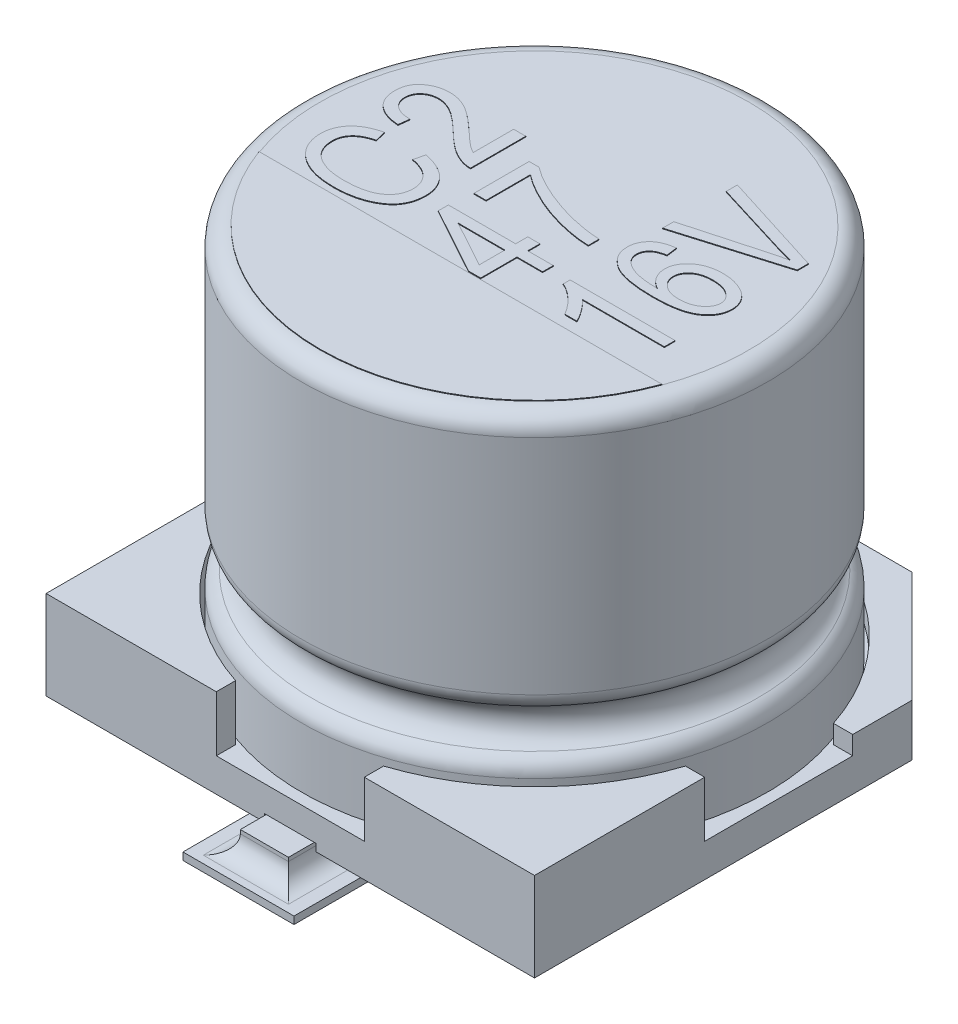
from build123d import *

# Parameters (mm, degrees)
SKETCH1_W                = 6.6
SKETCH1_H                = 6.6
BOSS_EXTRUDE1_DEPTH      = 1.2
CUT_EXTRUDE1_DEPTH       = 0.75
CUT_EXTRUDE2_DEPTH       = 5.902040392
CUT_EXTRUDE2_DEPTH_BACK  = 5.902040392
SKETCH3_W                = 3.3
SKETCH3_H                = 0.5
CHAMFER1_SIZE            = 1.5
CUT_EXTRUDE3_DEPTH       = 0.1
BOSS_EXTRUDE4_DEPTH      = 0.3
BOSS_EXTRUDE4_DEPTH_BACK = 0.1
SKETCH8_R                = 0.5
BOSS_EXTRUDE5_DEPTH      = 0.3
SKETCH9_W                = 1.5
SKETCH9_H                = 2
BOSS_EXTRUDE6_DEPTH      = 0.1
FILLET1_R                = 0.25
BOSS_EXTRUDE7_DEPTH      = 0.01


with BuildPart() as part:
    # Sketch1 → Boss-Extrude1 (new body)
    with BuildSketch(Plane(origin=(0, 0.3, 0), x_dir=(1, 0, 0), z_dir=(0, 1, 0))):
        Rectangle(SKETCH1_W, SKETCH1_H)
    extrude(amount=BOSS_EXTRUDE1_DEPTH)

    # Sketch2 → Cut-Extrude1 (cut)
    with BuildSketch(Plane(origin=(0, 1.5, 0), x_dir=(1, 0, 0), z_dir=(0, 1, 0))):
        with BuildLine():
            Line((-3.3, 1), (-3.039736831, 1))
            ThreePointArc((-3.039736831, 1), (-2.2627417, 2.2627417), (-1, 3.039736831))
            Line((-1, 3.039736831), (-1, 3.3))
            Line((-1, 3.3), (1, 3.3))
            Line((1, 3.3), (1, 3.039736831))
            ThreePointArc((1, 3.039736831), (2.2627417, 2.2627417), (3.039736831, 1))
            Line((3.039736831, 1), (3.3, 1))
            Line((3.3, 1), (3.3, -1))
            Line((3.3, -1), (3.039736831, -1))
            ThreePointArc((3.039736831, -1), (2.2627417, -2.2627417), (1, -3.039736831))
            Line((1, -3.039736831), (1, -3.3))
            Line((1, -3.3), (-1, -3.3))
            Line((-1, -3.3), (-1, -3.039736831))
            ThreePointArc((-1, -3.039736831), (-2.2627417, -2.2627417), (-3.039736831, -1))
            Line((-3.039736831, -1), (-3.3, -1))
            Line((-3.3, -1), (-3.3, 1))
        make_face()
    extrude(amount=-CUT_EXTRUDE1_DEPTH, mode=Mode.SUBTRACT)

    # Sketch3 → Cut-Extrude2 (cut, two sides: drawn at the far end of the back side and taken through both)
    with BuildSketch(Plane(origin=(0, 0, 0), x_dir=(0, 0, -1), z_dir=(1, 0, 0)).offset(-CUT_EXTRUDE2_DEPTH_BACK)):
        with Locations((1.65, 1.25)):
            Rectangle(SKETCH3_W, SKETCH3_H)
    extrude(amount=CUT_EXTRUDE2_DEPTH + CUT_EXTRUDE2_DEPTH_BACK, mode=Mode.SUBTRACT)

    # Chamfer1
    chamfer1_edges = [part.edges().sort_by_distance(p)[0] for p in [
        (3.3, 0.65, -3.3),
        (-3.3, 0.65, -3.3),
    ]]
    chamfer(chamfer1_edges, length=CHAMFER1_SIZE)

    # Sketch7 → Cut-Extrude3 (cut)
    with BuildSketch(Plane.XZ.offset(-0.3)):
        with BuildLine():
            Line((-0.35, 3.3), (0.35, 3.3))
            Line((0.35, 3.3), (0.498675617, 1.261367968))
            ThreePointArc((0.498675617, 1.261367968), (0, 0.725), (-0.498675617, 1.261367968))
            Line((-0.498675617, 1.261367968), (-0.35, 3.3))
        make_face()
        with BuildLine():
            Line((-0.35, -3.3), (0.35, -3.3))
            Line((0.35, -3.3), (0.498675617, -1.261367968))
            ThreePointArc((0.498675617, -1.261367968), (0, -0.725), (-0.498675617, -1.261367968))
            Line((-0.498675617, -1.261367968), (-0.35, -3.3))
        make_face()
    extrude(amount=-CUT_EXTRUDE3_DEPTH, mode=Mode.SUBTRACT)

    # Sketch6 → Boss-Extrude4 (add, two sides: drawn at the far end of the back side and taken through both)
    with BuildSketch(Plane.XZ.offset(-0.3).offset(-BOSS_EXTRUDE4_DEPTH_BACK)):
        with BuildLine():
            Line((-0.325, -1.225), (-0.325, -3.65))
            Line((-0.325, -3.65), (0.325, -3.65))
            Line((0.325, -3.65), (0.325, -1.225))
            ThreePointArc((0.325, -1.225), (0, -0.9), (-0.325, -1.225))
        make_face()
        with BuildLine():
            Line((-0.325, 1.225), (-0.325, 3.65))
            Line((-0.325, 3.65), (0.325, 3.65))
            Line((0.325, 3.65), (0.325, 1.225))
            ThreePointArc((0.325, 1.225), (0, 0.9), (-0.325, 1.225))
        make_face()
    extrude(amount=BOSS_EXTRUDE4_DEPTH + BOSS_EXTRUDE4_DEPTH_BACK)

    # Sketch8 → Boss-Extrude5 (add)
    with BuildSketch(Plane.XZ.offset(-0.3)):
        with Locations(Location((-2, 2, 0), (0, 0, 270))):
            Circle(SKETCH8_R)
        with Locations(Location((2, 2, 0), (0, 0, 270))):
            Circle(SKETCH8_R)
        with Locations(Location((2, -2, 0), (0, 0, 270))):
            Circle(SKETCH8_R)
        with Locations(Location((-2, -2, 0), (0, 0, 270))):
            Circle(SKETCH8_R)
    extrude(amount=BOSS_EXTRUDE5_DEPTH)

    # Sketch9 → Boss-Extrude6 (add)
    with BuildSketch(Plane(origin=(0, 0, 0), x_dir=(1, 0, 0), z_dir=(0, 1, 0))):
        with Locations((0, 3)):
            Rectangle(SKETCH9_W, SKETCH9_H)
        with Locations((0, -3)):
            Rectangle(SKETCH9_W, SKETCH9_H)
    extrude(amount=BOSS_EXTRUDE6_DEPTH)

    # Fillet1
    fillet1_edges = [part.edges().sort_by_distance(p)[0] for p in [
        (0.325, 0.1, -2.825),
        (0, 0.1, -3.65),
        (-0.325, 0.1, -2.825),
        (-0.325, 0.1, 2.825),
        (0, 0.1, 3.65),
        (0.325, 0.1, 2.825),
    ]]
    fillet(fillet1_edges, radius=FILLET1_R)


with BuildPart() as body_2:
    # Sketch4 → Revolve1 (revolve)
    with BuildSketch(Plane(origin=(0, 0, 0), x_dir=(0, 0, -1), z_dir=(1, 0, 0)), mode=Mode.PRIVATE) as revolve1_sk:
        with BuildLine():
            Line((0, 0.75), (0, 5.8))
            Line((0, 5.8), (-2.9, 5.8))
            ThreePointArc((-2.9, 5.8), (-3.076776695, 5.726776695), (-3.15, 5.55))
            Line((-3.15, 5.55), (-3.15, 2.539897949))
            ThreePointArc((-3.15, 2.539897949), (-3.113200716, 2.409339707), (-3.013636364, 2.317217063))
            ThreePointArc((-3.013636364, 2.317217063), (-2.85, 2.05), (-3.013636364, 1.782782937))
            ThreePointArc((-3.013636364, 1.782782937), (-3.113200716, 1.690660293), (-3.15, 1.560102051))
            Line((-3.15, 1.560102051), (-3.15, 0.75))
            Line((-3.15, 0.75), (0, 0.75))
        make_face()
    revolve(revolve1_sk.sketch.rotate(Axis((0, 0, 0), (0, 1, 0)), 180), axis=Axis((0, 0, 0), (0, 1, 0)))

    # Sketch10 → Boss-Extrude7 (add)
    # profile 1 of 8: a face of its own
    with BuildSketch(Plane(origin=(0, 5.8, 0), x_dir=(1, 0, 0), z_dir=(0, 1, 0))):
        with BuildLine():
            Line((-2.722131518, -1), (2.722131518, -1))
            ThreePointArc((2.722131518, -1), (0, -2.9), (-2.722131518, -1))
        make_face()
    # profile 2 of 8: a face of its own
    with BuildSketch(Plane(origin=(0, 5.8, 0), x_dir=(1, 0, 0), z_dir=(0, 1, 0))):
        with BuildLine():
            Line((-1.590909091, -0.054545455), (-1.554545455, 0.090909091))
            add(Edge.make_bspline(
                [(-1.554545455, 0.090909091), (-1.535269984, 0.086573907), (-1.497690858, 0.078122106), (-1.443641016, 0.062267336), (-1.39347407, 0.043748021), (-1.347020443, 0.023039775), (-1.304271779, 0.000124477), (-1.26542753, -0.02529249), (-1.230157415, -0.052859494), (-1.199022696, -0.0830881), (-1.1711564, -0.11498153), (-1.147359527, -0.148885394), (-1.126876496, -0.184353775), (-1.110494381, -0.221648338), (-1.097542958, -0.26053486), (-1.088602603, -0.301197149), (-1.082613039, -0.343476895), (-1.082085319, -0.372327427), (-1.081818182, -0.386931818)],
                knots=[0, 0, 0, 0, 1.289353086, 2.513700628, 3.673385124, 4.777321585, 5.831023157, 6.835648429, 7.803886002, 8.748111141, 9.663929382, 10.564264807, 11.447463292, 12.332994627, 13.21843967, 14.118159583, 15.047395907, 16, 16, 16, 16], degree=3))
            add(Edge.make_bspline(
                [(-1.081818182, -0.386931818), (-1.08199604, -0.399821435), (-1.082344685, -0.425088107), (-1.08628588, -0.462271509), (-1.092042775, -0.49811477), (-1.100709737, -0.532535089), (-1.111320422, -0.565607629), (-1.12494552, -0.597015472), (-1.140459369, -0.627260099), (-1.158765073, -0.656028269), (-1.179571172, -0.683485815), (-1.203389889, -0.709483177), (-1.230089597, -0.734193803), (-1.259944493, -0.757429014), (-1.292153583, -0.780002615), (-1.327732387, -0.800693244), (-1.366087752, -0.820236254), (-1.407117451, -0.838589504), (-1.450494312, -0.855557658), (-1.496291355, -0.869438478), (-1.543730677, -0.881811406), (-1.593174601, -0.891633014), (-1.644419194, -0.899736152), (-1.697742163, -0.904867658), (-1.752885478, -0.90849447), (-1.79033462, -0.908889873), (-1.809375, -0.909090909)],
                knots=[0, 0, 0, 0, 0.921073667, 1.805520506, 2.670265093, 3.514196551, 4.340540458, 5.150330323, 5.958760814, 6.76821105, 7.584651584, 8.418448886, 9.285522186, 10.182088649, 11.121025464, 12.095129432, 13.121488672, 14.19720655, 15.30730909, 16.448576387, 17.61598683, 18.810867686, 20.050753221, 21.323199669, 22.639026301, 24, 24, 24, 24], degree=3))
            add(Edge.make_bspline(
                [(-1.809375, -0.909090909), (-1.828131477, -0.908891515), (-1.864918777, -0.908500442), (-1.918927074, -0.904879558), (-1.970836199, -0.89976115), (-2.020467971, -0.891629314), (-2.068038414, -0.881875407), (-2.113230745, -0.869546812), (-2.156417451, -0.855465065), (-2.197183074, -0.838717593), (-2.23556886, -0.819854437), (-2.271703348, -0.799665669), (-2.305636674, -0.7782885), (-2.336754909, -0.754647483), (-2.365716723, -0.729906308), (-2.392050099, -0.703226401), (-2.415889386, -0.675051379), (-2.437612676, -0.645533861), (-2.456445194, -0.614609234), (-2.473168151, -0.582906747), (-2.487044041, -0.550190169), (-2.498446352, -0.516578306), (-2.507309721, -0.482103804), (-2.51340371, -0.446753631), (-2.517701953, -0.410616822), (-2.518020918, -0.386187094), (-2.518181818, -0.373863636)],
                knots=[0, 0, 0, 0, 1.355026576, 2.657629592, 3.909672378, 5.122282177, 6.289750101, 7.416737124, 8.50507279, 9.569838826, 10.598010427, 11.593540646, 12.559644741, 13.492918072, 14.414658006, 15.309728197, 16.19807831, 17.079418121, 17.954841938, 18.811754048, 19.667052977, 20.519555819, 21.374197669, 22.235876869, 23.110096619, 24, 24, 24, 24], degree=3))
            add(Edge.make_bspline(
                [(-2.518181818, -0.373863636), (-2.517836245, -0.360403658), (-2.517157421, -0.333963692), (-2.51232314, -0.2949276), (-2.50375071, -0.257491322), (-2.491963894, -0.221400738), (-2.477319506, -0.186648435), (-2.458926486, -0.153497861), (-2.437231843, -0.121829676), (-2.412151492, -0.091753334), (-2.384064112, -0.063268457), (-2.352642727, -0.037053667), (-2.318021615, -0.013198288), (-2.280592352, 0.008720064), (-2.239836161, 0.028077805), (-2.196104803, 0.045195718), (-2.149383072, 0.060899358), (-2.116737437, 0.06871843), (-2.1, 0.072727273)],
                knots=[0, 0, 0, 0, 0.96928357, 1.904001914, 2.82717962, 3.730829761, 4.635277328, 5.538798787, 6.456240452, 7.39579775, 8.3554607, 9.333438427, 10.337996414, 11.380185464, 12.453917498, 13.583566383, 14.761092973, 16, 16, 16, 16], degree=3))
            Line((-2.1, 0.072727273), (-2.063636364, -0.072727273))
            add(Edge.make_bspline(
                [(-2.063636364, -0.072727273), (-2.075415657, -0.076014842), (-2.09838882, -0.082426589), (-2.131385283, -0.093836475), (-2.16212884, -0.106315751), (-2.190702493, -0.119878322), (-2.216858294, -0.134981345), (-2.240809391, -0.151183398), (-2.262622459, -0.168512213), (-2.281837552, -0.18733177), (-2.299174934, -0.207015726), (-2.314027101, -0.228167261), (-2.326434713, -0.250610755), (-2.336864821, -0.274143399), (-2.344710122, -0.29883956), (-2.350488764, -0.324780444), (-2.353897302, -0.351897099), (-2.354327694, -0.370445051), (-2.354545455, -0.379829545)],
                knots=[0, 0, 0, 0, 1.274827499, 2.486296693, 3.637698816, 4.732866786, 5.781146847, 6.783409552, 7.745577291, 8.681189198, 9.583979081, 10.476943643, 11.369744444, 12.253932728, 13.156290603, 14.066553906, 15.021756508, 16, 16, 16, 16], degree=3))
            add(Edge.make_bspline(
                [(-2.354545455, -0.379829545), (-2.35385919, -0.398352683), (-2.352520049, -0.434497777), (-2.341380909, -0.486774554), (-2.32356338, -0.535415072), (-2.302183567, -0.572435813), (-2.281676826, -0.599884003), (-2.264145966, -0.619341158), (-2.244571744, -0.637656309), (-2.223156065, -0.655079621), (-2.199729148, -0.671452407), (-2.174116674, -0.68659933), (-2.146678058, -0.700674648), (-2.117280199, -0.71391907), (-2.085725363, -0.725452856), (-2.052144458, -0.735658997), (-2.016608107, -0.744497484), (-1.97904312, -0.751570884), (-1.939483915, -0.756840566), (-1.897893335, -0.760900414), (-1.854284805, -0.763081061), (-1.824528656, -0.763448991), (-1.809375, -0.763636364)],
                knots=[0, 0, 0, 0, 1.477150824, 2.882435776, 4.245666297, 5.596604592, 6.276856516, 6.977993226, 7.683799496, 8.414501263, 9.17983833, 9.962775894, 10.787606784, 11.640228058, 12.534608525, 13.467077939, 14.440493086, 15.455932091, 16.516312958, 17.624894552, 18.790450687, 20, 20, 20, 20], degree=3))
            add(Edge.make_bspline(
                [(-1.809375, -0.763636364), (-1.7866406, -0.763277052), (-1.742545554, -0.76258014), (-1.678505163, -0.758136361), (-1.618781, -0.750361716), (-1.56357216, -0.73894853), (-1.512700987, -0.724850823), (-1.466148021, -0.70769878), (-1.424108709, -0.686842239), (-1.3864956, -0.663014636), (-1.353335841, -0.636428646), (-1.324444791, -0.607743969), (-1.300117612, -0.576779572), (-1.279890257, -0.543911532), (-1.264590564, -0.508650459), (-1.253399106, -0.471491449), (-1.246760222, -0.43214949), (-1.24589616, -0.405233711), (-1.245454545, -0.391477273)],
                knots=[0, 0, 0, 0, 1.437104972, 2.787371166, 4.055570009, 5.241294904, 6.348053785, 7.389870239, 8.372351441, 9.308936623, 10.198930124, 11.053953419, 11.87666206, 12.682560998, 13.486679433, 14.299132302, 15.130700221, 16, 16, 16, 16], degree=3))
            add(Edge.make_bspline(
                [(-1.245454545, -0.391477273), (-1.245736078, -0.381236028), (-1.246290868, -0.361054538), (-1.250438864, -0.331302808), (-1.25684292, -0.302519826), (-1.266278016, -0.274802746), (-1.278603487, -0.248317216), (-1.293435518, -0.222915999), (-1.310955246, -0.1985858), (-1.331001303, -0.175372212), (-1.35388971, -0.153621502), (-1.379633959, -0.133728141), (-1.407978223, -0.115505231), (-1.439304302, -0.099629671), (-1.473213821, -0.085434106), (-1.509927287, -0.072944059), (-1.549417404, -0.062419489), (-1.576856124, -0.057212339), (-1.590909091, -0.054545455)],
                knots=[0, 0, 0, 0, 0.928238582, 1.829195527, 2.718541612, 3.598220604, 4.477899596, 5.362883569, 6.261136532, 7.192387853, 8.139765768, 9.118675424, 10.13801499, 11.190128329, 12.298336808, 13.468533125, 14.703488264, 16, 16, 16, 16], degree=3))
        make_face()
    # profile 3 of 8: a face of its own
    with BuildSketch(Plane(origin=(0, 5.8, 0), x_dir=(1, 0, 0), z_dir=(0, 1, 0))):
        with BuildLine():
            Line((-1.263636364, 0.981818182), (-1.1, 0.981818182))
            Line((-1.1, 0.981818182), (-1.1, 0.236363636))
            add(Edge.make_bspline(
                [(-1.1, 0.236363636), (-1.108526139, 0.236329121), (-1.125800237, 0.236259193), (-1.152136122, 0.238584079), (-1.179109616, 0.243360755), (-1.207080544, 0.249460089), (-1.235681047, 0.258108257), (-1.265050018, 0.268695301), (-1.295114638, 0.281186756), (-1.326051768, 0.295814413), (-1.358163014, 0.312902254), (-1.391293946, 0.333544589), (-1.426060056, 0.357133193), (-1.462027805, 0.384239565), (-1.499539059, 0.414376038), (-1.538420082, 0.447691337), (-1.578884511, 0.484046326), (-1.605760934, 0.509953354), (-1.619602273, 0.523295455)],
                knots=[0, 0, 0, 0, 0.672196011, 1.361880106, 2.081368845, 2.831486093, 3.618364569, 4.435734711, 5.292876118, 6.184871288, 7.133796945, 8.159796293, 9.26180684, 10.446293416, 11.710635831, 13.056147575, 14.483918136, 16, 16, 16, 16], degree=3))
            add(Edge.make_bspline(
                [(-1.619602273, 0.523295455), (-1.635637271, 0.538798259), (-1.666511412, 0.568647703), (-1.712098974, 0.610657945), (-1.754472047, 0.648828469), (-1.79439686, 0.682396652), (-1.831329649, 0.711958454), (-1.865217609, 0.737811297), (-1.896829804, 0.758719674), (-1.934026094, 0.781294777), (-1.978307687, 0.802816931), (-2.029924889, 0.821843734), (-2.079823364, 0.834137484), (-2.112720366, 0.835636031), (-2.128693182, 0.836363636)],
                knots=[0, 0, 0, 0, 1.312560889, 2.527233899, 3.64818266, 4.668586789, 5.596397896, 6.432357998, 7.175835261, 7.825761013, 8.992224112, 10.065918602, 11.060925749, 12, 12, 12, 12], degree=3))
            add(Edge.make_bspline(
                [(-2.128693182, 0.836363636), (-2.137511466, 0.836262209), (-2.154734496, 0.836064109), (-2.179886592, 0.832696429), (-2.20381126, 0.827895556), (-2.226676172, 0.821550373), (-2.248124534, 0.812577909), (-2.268306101, 0.801705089), (-2.28748668, 0.78927231), (-2.305000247, 0.774764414), (-2.320799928, 0.758906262), (-2.334944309, 0.74215364), (-2.34650537, 0.724224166), (-2.356081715, 0.705487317), (-2.363408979, 0.685830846), (-2.368899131, 0.665304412), (-2.372018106, 0.643845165), (-2.37248854, 0.629270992), (-2.372727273, 0.621875)],
                knots=[0, 0, 0, 0, 1.164144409, 2.273695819, 3.345940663, 4.387378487, 5.402712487, 6.410231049, 7.41307794, 8.417484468, 9.408318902, 10.367853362, 11.308274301, 12.220303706, 13.142827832, 14.074469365, 15.022846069, 16, 16, 16, 16], degree=3))
            add(Edge.make_bspline(
                [(-2.372727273, 0.621875), (-2.37256065, 0.613900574), (-2.372235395, 0.59833413), (-2.36816798, 0.575651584), (-2.362773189, 0.553892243), (-2.354244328, 0.533328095), (-2.34393617, 0.513567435), (-2.330480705, 0.495423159), (-2.315464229, 0.477851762), (-2.297847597, 0.461699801), (-2.277843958, 0.447282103), (-2.255995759, 0.434340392), (-2.231759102, 0.423909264), (-2.205732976, 0.415143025), (-2.177605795, 0.408257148), (-2.147464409, 0.403659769), (-2.115321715, 0.400286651), (-2.093191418, 0.400097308), (-2.081818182, 0.4)],
                knots=[0, 0, 0, 0, 0.928593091, 1.812656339, 2.680433, 3.537535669, 4.402074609, 5.272376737, 6.164676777, 7.094647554, 8.050991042, 9.035788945, 10.049325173, 11.121325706, 12.235436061, 13.420862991, 14.67452591, 16, 16, 16, 16], degree=3))
            Line((-2.081818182, 0.4), (-2.1, 0.254545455))
            add(Edge.make_bspline(
                [(-2.1, 0.254545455), (-2.116878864, 0.256044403), (-2.149624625, 0.258952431), (-2.197028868, 0.266582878), (-2.241012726, 0.277169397), (-2.282009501, 0.289743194), (-2.319529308, 0.305538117), (-2.354259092, 0.323315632), (-2.385594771, 0.344104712), (-2.41358887, 0.367471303), (-2.438135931, 0.393219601), (-2.459470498, 0.420881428), (-2.477973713, 0.450326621), (-2.492661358, 0.48196961), (-2.504113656, 0.515601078), (-2.512301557, 0.551095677), (-2.517184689, 0.588595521), (-2.517844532, 0.61418989), (-2.518181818, 0.627272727)],
                knots=[0, 0, 0, 0, 1.296016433, 2.514330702, 3.668705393, 4.754684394, 5.790583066, 6.778804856, 7.735156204, 8.660808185, 9.562568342, 10.450784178, 11.329227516, 12.217177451, 13.112894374, 14.042449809, 14.999377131, 16, 16, 16, 16], degree=3))
            add(Edge.make_bspline(
                [(-2.518181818, 0.627272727), (-2.51777024, 0.641399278), (-2.51696883, 0.66890602), (-2.511606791, 0.708928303), (-2.502364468, 0.746367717), (-2.488775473, 0.780952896), (-2.472086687, 0.813059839), (-2.451359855, 0.842398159), (-2.426718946, 0.8689373), (-2.398630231, 0.892533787), (-2.368318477, 0.913392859), (-2.336619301, 0.931592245), (-2.304062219, 0.947379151), (-2.270283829, 0.959716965), (-2.235737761, 0.970020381), (-2.199900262, 0.976493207), (-2.163184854, 0.98105003), (-2.138366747, 0.981560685), (-2.125852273, 0.981818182)],
                knots=[0, 0, 0, 0, 1.141316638, 2.222333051, 3.255980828, 4.24919085, 5.217781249, 6.173073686, 7.14226832, 8.135684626, 9.131102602, 10.111468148, 11.086834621, 12.050425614, 13.014198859, 13.995608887, 14.989290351, 16, 16, 16, 16], degree=3))
            add(Edge.make_bspline(
                [(-2.125852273, 0.981818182), (-2.11457728, 0.981575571), (-2.092174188, 0.98109351), (-2.058747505, 0.977957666), (-2.025770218, 0.972422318), (-1.992925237, 0.965234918), (-1.960721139, 0.955035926), (-1.928646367, 0.943490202), (-1.897063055, 0.92948583), (-1.865353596, 0.912954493), (-1.832400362, 0.893593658), (-1.797582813, 0.870413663), (-1.75999161, 0.843695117), (-1.720068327, 0.812894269), (-1.677371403, 0.778503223), (-1.632239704, 0.74007834), (-1.584581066, 0.697748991), (-1.552225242, 0.667949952), (-1.535511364, 0.652556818)],
                knots=[0, 0, 0, 0, 0.780531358, 1.550893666, 2.321451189, 3.094347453, 3.876089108, 4.657940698, 5.453333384, 6.265487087, 7.132311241, 8.097757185, 9.160053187, 10.324349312, 11.587703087, 12.955031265, 14.427076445, 16, 16, 16, 16], degree=3))
            add(Edge.make_bspline(
                [(-1.535511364, 0.652556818), (-1.525120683, 0.642774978), (-1.505263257, 0.624081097), (-1.476459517, 0.597787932), (-1.450627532, 0.573694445), (-1.427113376, 0.552619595), (-1.406420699, 0.533879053), (-1.387872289, 0.518474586), (-1.372371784, 0.50522937), (-1.347533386, 0.485906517), (-1.312497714, 0.461520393), (-1.279547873, 0.444555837), (-1.263636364, 0.436363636)],
                knots=[0, 0, 0, 0, 1.227426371, 2.345710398, 3.354421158, 4.265580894, 5.061720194, 5.755250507, 6.339260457, 6.815034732, 8.461977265, 10, 10, 10, 10], degree=3))
            Line((-1.263636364, 0.436363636), (-1.263636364, 0.981818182))
        make_face()
    # profile 4 of 8: a face of its own
    with BuildSketch(Plane(origin=(0, 5.8, 0), x_dir=(1, 0, 0), z_dir=(0, 1, 0))):
        Polygon((0.6, -0.490909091), (0.254545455, -0.490909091), (0.254545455, -0.981818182), (0.090909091, -0.981818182), (-0.818181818, -0.482670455), (-0.818181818, -0.345454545), (0.090909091, -0.345454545), (0.090909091, -0.181818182), (0.254545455, -0.181818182), (0.254545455, -0.345454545), (0.6, -0.345454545), align=None)
        Polygon((0.090909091, -0.490909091), (-0.541761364, -0.490909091), (0.090909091, -0.838352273), align=None, mode=Mode.SUBTRACT)
    # profile 5 of 8: a face of its own
    with BuildSketch(Plane(origin=(0, 5.8, 0), x_dir=(1, 0, 0), z_dir=(0, 1, 0))):
        with BuildLine():
            Line((-0.618181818, -0.036363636), (-0.781818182, -0.036363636))
            Line((-0.781818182, -0.036363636), (-0.781818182, 0.709090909))
            Line((-0.781818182, 0.709090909), (-0.648011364, 0.709090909))
            add(Edge.make_bspline(
                [(-0.648011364, 0.709090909), (-0.629493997, 0.695259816), (-0.591802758, 0.667107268), (-0.531511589, 0.627736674), (-0.467300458, 0.589447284), (-0.399115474, 0.552202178), (-0.326735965, 0.516442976), (-0.250395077, 0.481792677), (-0.169863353, 0.448671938), (-0.086180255, 0.416771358), (-0.000509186, 0.387072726), (0.085833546, 0.360699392), (0.172037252, 0.337560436), (0.258041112, 0.318119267), (0.343740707, 0.301430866), (0.429233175, 0.288433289), (0.514618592, 0.278624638), (0.571572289, 0.274690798), (0.6, 0.272727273)],
                knots=[0, 0, 0, 0, 0.828228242, 1.685820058, 2.579325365, 3.507361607, 4.469713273, 5.472243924, 6.511632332, 7.590183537, 8.68180921, 9.76082494, 10.825356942, 11.880104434, 12.920528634, 13.95402052, 14.978775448, 16, 16, 16, 16], degree=3))
            Line((0.6, 0.272727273), (0.6, 0.127272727))
            add(Edge.make_bspline(
                [(0.6, 0.127272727), (0.585031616, 0.127721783), (0.554496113, 0.128637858), (0.507812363, 0.132321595), (0.459263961, 0.136926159), (0.408898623, 0.14395977), (0.356690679, 0.152404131), (0.302660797, 0.16282712), (0.246691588, 0.174269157), (0.169998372, 0.192613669), (0.07400088, 0.218383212), (-0.039052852, 0.255716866), (-0.149665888, 0.297377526), (-0.256248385, 0.345139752), (-0.357722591, 0.395822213), (-0.451901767, 0.449612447), (-0.539097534, 0.503996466), (-0.592310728, 0.544126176), (-0.618181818, 0.563636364)],
                knots=[0, 0, 0, 0, 0.547560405, 1.117023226, 1.712128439, 2.330702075, 2.976322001, 3.646013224, 4.342857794, 5.065247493, 6.529539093, 7.976213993, 9.417556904, 10.850065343, 12.245478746, 13.563746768, 14.815546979, 16, 16, 16, 16], degree=3))
            Line((-0.618181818, 0.563636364), (-0.618181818, -0.036363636))
        make_face()
    # profile 6 of 8: a face of its own
    with BuildSketch(Plane(origin=(0, 5.8, 0), x_dir=(1, 0, 0), z_dir=(0, 1, 0))):
        with BuildLine():
            Line((2.3, -0.4), (2.3, -0.545454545))
            Line((2.3, -0.545454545), (1.190909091, -0.545454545))
            add(Edge.make_bspline(
                [(1.190909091, -0.545454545), (1.201187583, -0.554390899), (1.222489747, -0.572911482), (1.252821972, -0.60494637), (1.283744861, -0.640961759), (1.314142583, -0.680475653), (1.343094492, -0.721004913), (1.369022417, -0.760723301), (1.391194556, -0.798732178), (1.403286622, -0.824158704), (1.409090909, -0.836363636)],
                knots=[0, 0, 0, 0, 0.892632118, 1.84997915, 2.889208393, 4.004565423, 5.117638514, 6.154471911, 7.114131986, 8, 8, 8, 8], degree=3))
            Line((1.409090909, -0.836363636), (1.245454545, -0.836363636))
            add(Edge.make_bspline(
                [(1.245454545, -0.836363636), (1.233642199, -0.816748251), (1.210118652, -0.777685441), (1.169417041, -0.722834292), (1.125143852, -0.671296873), (1.077511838, -0.624163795), (1.028626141, -0.581775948), (0.979606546, -0.545645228), (0.931206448, -0.51592592), (0.897903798, -0.50135576), (0.881818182, -0.494318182)],
                knots=[0, 0, 0, 0, 1.082336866, 2.155405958, 3.2255179, 4.292702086, 5.32152541, 6.282639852, 7.170492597, 8, 8, 8, 8], degree=3))
            Line((0.881818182, -0.494318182), (0.881818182, -0.4))
            Line((0.881818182, -0.4), (2.3, -0.4))
        make_face()
    # profile 7 of 8: a face of its own
    with BuildSketch(Plane(origin=(0, 5.8, 0), x_dir=(1, 0, 0), z_dir=(0, 1, 0))):
        with BuildLine():
            Line((1.227272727, 0.690909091), (1.245454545, 0.545454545))
            add(Edge.make_bspline(
                [(1.245454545, 0.545454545), (1.228888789, 0.542092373), (1.197868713, 0.535796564), (1.155846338, 0.522141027), (1.120711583, 0.506926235), (1.102068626, 0.492856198), (1.093465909, 0.486363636)],
                knots=[0, 0, 0, 0, 1.230211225, 2.30362229, 3.217213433, 4, 4, 4, 4], degree=3))
            add(Edge.make_bspline(
                [(1.093465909, 0.486363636), (1.088151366, 0.481642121), (1.077817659, 0.47246151), (1.06443174, 0.457203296), (1.052895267, 0.441493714), (1.043396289, 0.424973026), (1.036294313, 0.407446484), (1.031211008, 0.389240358), (1.027970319, 0.370378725), (1.02750664, 0.357588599), (1.027272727, 0.351136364)],
                knots=[0, 0, 0, 0, 1.09495211, 2.12904747, 3.12182315, 4.09596367, 5.058329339, 6.028853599, 7.005615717, 8, 8, 8, 8], degree=3))
            add(Edge.make_bspline(
                [(1.027272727, 0.351136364), (1.027643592, 0.341140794), (1.028378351, 0.32133756), (1.036299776, 0.29259891), (1.048194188, 0.265239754), (1.065396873, 0.239642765), (1.087299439, 0.215759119), (1.113695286, 0.193080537), (1.145190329, 0.172459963), (1.1683489, 0.160489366), (1.180397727, 0.154261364)],
                knots=[0, 0, 0, 0, 0.906800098, 1.796553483, 2.691003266, 3.610512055, 4.585978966, 5.630213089, 6.767058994, 8, 8, 8, 8], degree=3))
            add(Edge.make_bspline(
                [(1.180397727, 0.154261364), (1.191962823, 0.149034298), (1.216006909, 0.138167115), (1.255189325, 0.125423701), (1.298133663, 0.114225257), (1.345214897, 0.105828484), (1.395945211, 0.098194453), (1.450776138, 0.093327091), (1.50943165, 0.090145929), (1.549900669, 0.089712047), (1.570738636, 0.089488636)],
                knots=[0, 0, 0, 0, 0.763508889, 1.587351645, 2.476402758, 3.433472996, 4.464603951, 5.563935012, 6.745641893, 8, 8, 8, 8], degree=3))
            add(Edge.make_bspline(
                [(1.570738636, 0.089488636), (1.556560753, 0.097725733), (1.52897336, 0.113753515), (1.492799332, 0.143597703), (1.461338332, 0.17571945), (1.435700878, 0.211098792), (1.41578701, 0.248661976), (1.401491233, 0.287551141), (1.392514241, 0.327527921), (1.391445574, 0.354594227), (1.390909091, 0.368181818)],
                knots=[0, 0, 0, 0, 1.127689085, 2.194262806, 3.218345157, 4.217743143, 5.19231177, 6.137448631, 7.064978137, 8, 8, 8, 8], degree=3))
            add(Edge.make_bspline(
                [(1.390909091, 0.368181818), (1.391301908, 0.37947435), (1.392076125, 0.401731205), (1.397935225, 0.434574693), (1.407678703, 0.46619161), (1.421078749, 0.496875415), (1.438700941, 0.526321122), (1.459989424, 0.55473775), (1.485384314, 0.581768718), (1.513778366, 0.607887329), (1.545762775, 0.631597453), (1.580606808, 0.652393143), (1.617945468, 0.67013848), (1.658109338, 0.68422275), (1.700620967, 0.695643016), (1.74586758, 0.703570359), (1.793660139, 0.708012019), (1.826411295, 0.708725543), (1.843181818, 0.709090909)],
                knots=[0, 0, 0, 0, 0.860357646, 1.695709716, 2.533583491, 3.377064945, 4.241047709, 5.143225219, 6.077846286, 7.063889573, 8.080111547, 9.106229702, 10.152257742, 11.225204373, 12.345649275, 13.503769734, 14.721782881, 16, 16, 16, 16], degree=3))
            add(Edge.make_bspline(
                [(1.843181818, 0.709090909), (1.865940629, 0.708510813), (1.910522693, 0.707374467), (1.975798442, 0.697853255), (2.037715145, 0.681816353), (2.086798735, 0.663659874), (2.123564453, 0.646174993), (2.149231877, 0.632320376), (2.172901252, 0.617317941), (2.195178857, 0.602033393), (2.214942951, 0.584975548), (2.233426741, 0.567774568), (2.249571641, 0.549145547), (2.268698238, 0.523655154), (2.28874725, 0.490162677), (2.30557452, 0.447135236), (2.316278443, 0.402226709), (2.317544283, 0.371460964), (2.318181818, 0.355965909)],
                knots=[0, 0, 0, 0, 1.657594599, 3.247049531, 4.793269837, 6.310589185, 7.051271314, 7.758283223, 8.434037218, 9.092523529, 9.724148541, 10.334150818, 10.930619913, 11.517069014, 12.655365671, 13.76103642, 14.872354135, 16, 16, 16, 16], degree=3))
            add(Edge.make_bspline(
                [(2.318181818, 0.355965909), (2.317691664, 0.342010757), (2.316727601, 0.314562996), (2.309050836, 0.274378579), (2.296867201, 0.236064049), (2.27958791, 0.199563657), (2.257265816, 0.164973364), (2.229710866, 0.132591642), (2.197512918, 0.10196948), (2.160507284, 0.073047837), (2.117363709, 0.047045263), (2.067941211, 0.024355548), (2.011839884, 0.005399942), (1.94919517, -0.009536), (1.880148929, -0.021787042), (1.804634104, -0.030399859), (1.722513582, -0.035469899), (1.665632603, -0.036058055), (1.636079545, -0.036363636)],
                knots=[0, 0, 0, 0, 0.76079261, 1.49636878, 2.22335124, 2.948937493, 3.692613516, 4.462506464, 5.262670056, 6.113081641, 7.019393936, 8.004001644, 9.074018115, 10.244225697, 11.513927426, 12.897326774, 14.387976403, 16, 16, 16, 16], degree=3))
            add(Edge.make_bspline(
                [(1.636079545, -0.036363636), (1.603305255, -0.036094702), (1.540170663, -0.035576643), (1.449090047, -0.030014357), (1.365309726, -0.021600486), (1.288866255, -0.009061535), (1.219622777, 0.006472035), (1.157689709, 0.026126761), (1.102740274, 0.048688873), (1.055355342, 0.075814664), (1.014476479, 0.105480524), (0.97930089, 0.137249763), (0.949000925, 0.170571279), (0.924311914, 0.206245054), (0.905466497, 0.244219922), (0.891582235, 0.283958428), (0.883542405, 0.325909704), (0.882398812, 0.354511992), (0.881818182, 0.369034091)],
                knots=[0, 0, 0, 0, 1.648729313, 3.176021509, 4.589257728, 5.883210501, 7.07130447, 8.156186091, 9.149022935, 10.053769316, 10.896205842, 11.685573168, 12.434569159, 13.157455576, 13.86058765, 14.561213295, 15.269491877, 16, 16, 16, 16], degree=3))
            add(Edge.make_bspline(
                [(0.881818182, 0.369034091), (0.88211765, 0.379555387), (0.88270796, 0.400294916), (0.886582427, 0.430807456), (0.893814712, 0.459878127), (0.903566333, 0.487625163), (0.915663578, 0.514288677), (0.931219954, 0.539251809), (0.949252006, 0.563066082), (0.969992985, 0.585418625), (0.993267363, 0.6063684), (1.019605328, 0.624677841), (1.04811713, 0.641196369), (1.079013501, 0.655861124), (1.11254524, 0.667933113), (1.148573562, 0.677796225), (1.186975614, 0.685905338), (1.21360504, 0.689211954), (1.227272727, 0.690909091)],
                knots=[0, 0, 0, 0, 0.965466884, 1.903123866, 2.815643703, 3.708762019, 4.59904389, 5.49616866, 6.401586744, 7.336219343, 8.290161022, 9.268947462, 10.273430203, 11.311221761, 12.402489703, 13.538768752, 14.73676065, 16, 16, 16, 16], degree=3))
        make_face()
        with BuildLine():
            add(Edge.make_bspline(
                [(1.837784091, 0.109090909), (1.850102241, 0.109299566), (1.874125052, 0.109706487), (1.90926333, 0.113153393), (1.942538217, 0.118929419), (1.974140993, 0.126260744), (2.003549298, 0.136806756), (2.031395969, 0.148861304), (2.057161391, 0.163737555), (2.08105205, 0.180441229), (2.102391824, 0.198691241), (2.121071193, 0.217945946), (2.137105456, 0.237680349), (2.149972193, 0.258474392), (2.160460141, 0.2797765), (2.167444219, 0.302118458), (2.171929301, 0.325009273), (2.172460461, 0.340509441), (2.172727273, 0.348295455)],
                knots=[0, 0, 0, 0, 1.295915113, 2.527288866, 3.709970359, 4.848208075, 5.935365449, 6.992568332, 8.036874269, 9.05966364, 10.056099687, 10.986214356, 11.87941223, 12.725402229, 13.554321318, 14.370446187, 15.18144582, 16, 16, 16, 16], degree=3))
            add(Edge.make_bspline(
                [(2.172727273, 0.348295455), (2.172428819, 0.355224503), (2.17183519, 0.369006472), (2.167840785, 0.389330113), (2.16075589, 0.408891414), (2.151411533, 0.428068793), (2.139004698, 0.446609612), (2.123928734, 0.464502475), (2.105983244, 0.481521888), (2.086082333, 0.498395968), (2.063343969, 0.513403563), (2.038940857, 0.527460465), (2.011901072, 0.538178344), (1.98325262, 0.547808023), (1.9522647, 0.554632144), (1.919498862, 0.560257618), (1.884510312, 0.562846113), (1.860608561, 0.563367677), (1.848295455, 0.563636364)],
                knots=[0, 0, 0, 0, 0.772713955, 1.536938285, 2.298458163, 3.087170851, 3.910203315, 4.779624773, 5.690759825, 6.665637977, 7.684919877, 8.72499675, 9.799719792, 10.921806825, 12.09248587, 13.333813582, 14.6265008, 16, 16, 16, 16], degree=3))
            add(Edge.make_bspline(
                [(1.848295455, 0.563636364), (1.836264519, 0.563378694), (1.812926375, 0.562878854), (1.778827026, 0.560144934), (1.746928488, 0.555059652), (1.716950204, 0.548000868), (1.689270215, 0.538572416), (1.663343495, 0.527586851), (1.639717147, 0.514105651), (1.618159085, 0.498918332), (1.599216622, 0.481977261), (1.582134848, 0.464548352), (1.568406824, 0.445533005), (1.556309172, 0.426225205), (1.547712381, 0.405496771), (1.540886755, 0.384081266), (1.537339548, 0.361574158), (1.536690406, 0.346316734), (1.536363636, 0.338636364)],
                knots=[0, 0, 0, 0, 1.34413917, 2.607420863, 3.817865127, 4.949372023, 6.043265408, 7.080878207, 8.089894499, 9.076140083, 10.020536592, 10.925912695, 11.795477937, 12.63545564, 13.464706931, 14.294565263, 15.141508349, 16, 16, 16, 16], degree=3))
            add(Edge.make_bspline(
                [(1.536363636, 0.338636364), (1.536521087, 0.331038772), (1.536832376, 0.316017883), (1.541156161, 0.294055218), (1.54724935, 0.272677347), (1.556619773, 0.252254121), (1.567906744, 0.232229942), (1.581976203, 0.213112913), (1.598667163, 0.194885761), (1.617544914, 0.177333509), (1.638690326, 0.161235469), (1.661887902, 0.147150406), (1.686968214, 0.135676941), (1.713632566, 0.12588541), (1.742135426, 0.11819808), (1.772469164, 0.112915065), (1.804573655, 0.109766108), (1.826507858, 0.109320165), (1.837784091, 0.109090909)],
                knots=[0, 0, 0, 0, 0.863336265, 1.706866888, 2.538958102, 3.388184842, 4.257154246, 5.151813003, 6.08274342, 7.06663784, 8.081968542, 9.102321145, 10.14869887, 11.215962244, 12.332381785, 13.503694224, 14.716665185, 16, 16, 16, 16], degree=3))
        make_face(mode=Mode.SUBTRACT)
    # profile 8 of 8: a face of its own
    with BuildSketch(Plane(origin=(0, 5.8, 0), x_dir=(1, 0, 0), z_dir=(0, 1, 0))):
        with BuildLine():
            Line((2.3, 1.250852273), (0.9, 0.832102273))
            Line((0.9, 0.832102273), (0.9, 0.981818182))
            Line((0.9, 0.981818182), (1.915625, 1.261931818))
            add(Edge.make_bspline(
                [(1.915625, 1.261931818), (1.93502513, 1.267188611), (1.973113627, 1.277509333), (2.029419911, 1.291882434), (2.083540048, 1.305617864), (2.119023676, 1.314057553), (2.136363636, 1.318181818)],
                knots=[0, 0, 0, 0, 1.058778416, 2.078711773, 3.061114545, 4, 4, 4, 4], degree=3))
            add(Edge.make_bspline(
                [(2.136363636, 1.318181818), (2.100128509, 1.327526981), (2.026165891, 1.346602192), (1.952964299, 1.368417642), (1.915625, 1.379545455)],
                knots=[0, 0, 0, 0, 0.979822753, 2, 2, 2, 2], degree=3))
            Line((1.915625, 1.379545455), (0.9, 1.690909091))
            Line((0.9, 1.690909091), (0.9, 1.842045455))
            Line((0.9, 1.842045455), (2.3, 1.401136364))
            Line((2.3, 1.401136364), (2.3, 1.250852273))
        make_face()
    extrude(amount=BOSS_EXTRUDE7_DEPTH)


solid = Compound([part.part, body_2.part])
